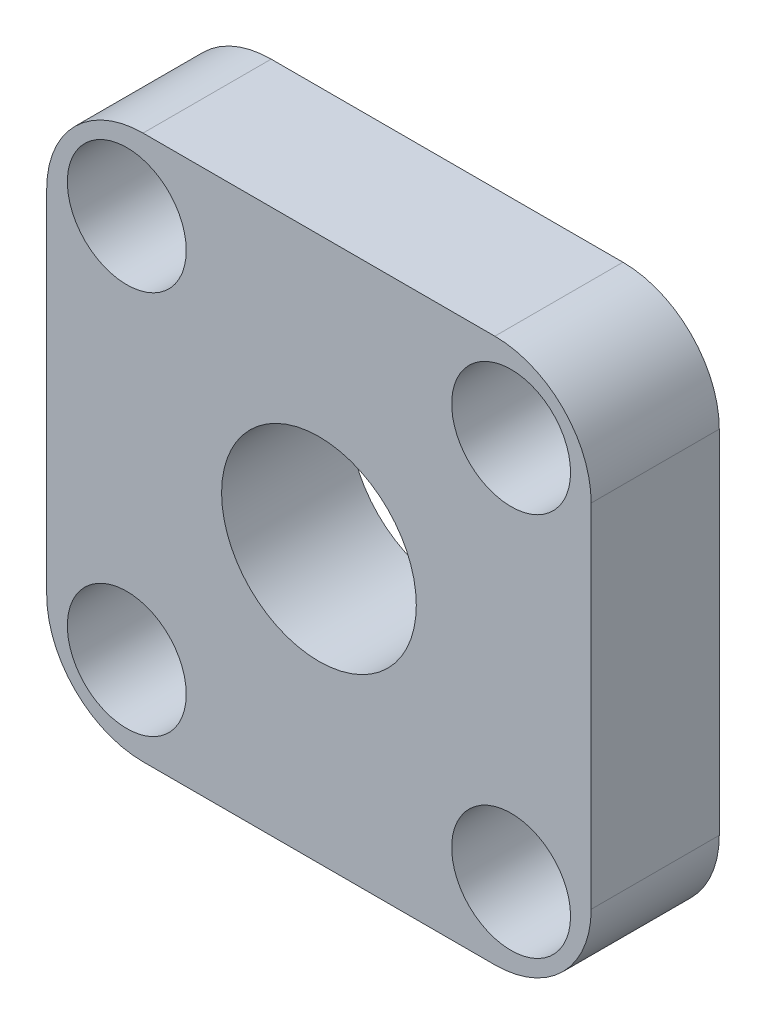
ISO-10303-21;
HEADER;
FILE_DESCRIPTION(('STEP AP214'),'2;1');
FILE_NAME('part.step','',(''),(''),'','','');
FILE_SCHEMA(('AUTOMOTIVE_DESIGN { 1 0 10303 214 1 1 1 1 }'));
ENDSEC;
DATA;
#1=APPLICATION_CONTEXT('core data for automotive mechanical design processes');
#2=APPLICATION_PROTOCOL_DEFINITION('international standard','automotive_design',2000,#1);
#3=PRODUCT_CONTEXT('',#1,'mechanical');
#4=PRODUCT('Part','Part','',(#3));
#5=PRODUCT_RELATED_PRODUCT_CATEGORY('part','',(#4));
#6=PRODUCT_DEFINITION_FORMATION('','',#4);
#7=PRODUCT_DEFINITION_CONTEXT('part definition',#1,'design');
#8=PRODUCT_DEFINITION('design','',#6,#7);
#9=PRODUCT_DEFINITION_SHAPE('','',#8);
#10=(LENGTH_UNIT() NAMED_UNIT(*) SI_UNIT(.MILLI.,.METRE.));
#11=(NAMED_UNIT(*) PLANE_ANGLE_UNIT() SI_UNIT($,.RADIAN.));
#12=(NAMED_UNIT(*) SI_UNIT($,.STERADIAN.) SOLID_ANGLE_UNIT());
#13=UNCERTAINTY_MEASURE_WITH_UNIT(LENGTH_MEASURE(1.E-05),#10,'distance_accuracy_value','');
#14=(GEOMETRIC_REPRESENTATION_CONTEXT(3) GLOBAL_UNCERTAINTY_ASSIGNED_CONTEXT((#13)) GLOBAL_UNIT_ASSIGNED_CONTEXT((#10,
#11,#12)) REPRESENTATION_CONTEXT('',''));
#15=CARTESIAN_POINT('',(0.,0.,0.));
#16=DIRECTION('',(0.,0.,1.));
#17=DIRECTION('',(1.,0.,0.));
#18=AXIS2_PLACEMENT_3D('',#15,#16,#17);
#19=CARTESIAN_POINT('',(-6.746875,-6.746875,3.17500000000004));
#20=DIRECTION('',(0.,0.,1.));
#21=DIRECTION('',(1.,0.,0.));
#22=AXIS2_PLACEMENT_3D('',#19,#20,#21);
#23=PLANE('',#22);
#24=CARTESIAN_POINT('',(4.7625,4.7625,3.17500000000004));
#25=DIRECTION('',(0.,0.,1.));
#26=DIRECTION('',(1.,0.,0.));
#27=AXIS2_PLACEMENT_3D('',#24,#25,#26);
#28=CIRCLE('',#27,1.4732);
#29=CARTESIAN_POINT('',(6.2357,4.7625,3.17500000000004));
#30=VERTEX_POINT('',#29);
#31=EDGE_CURVE('E210',#30,#30,#28,.T.);
#32=ORIENTED_EDGE('',*,*,#31,.F.);
#33=EDGE_LOOP('',(#32));
#34=FACE_BOUND('',#33,.T.);
#35=CARTESIAN_POINT('',(-4.7625,4.7625,3.17500000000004));
#36=DIRECTION('',(0.,0.,1.));
#37=DIRECTION('',(1.,0.,0.));
#38=AXIS2_PLACEMENT_3D('',#35,#36,#37);
#39=CIRCLE('',#38,1.4732);
#40=CARTESIAN_POINT('',(-3.2893,4.7625,3.17500000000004));
#41=VERTEX_POINT('',#40);
#42=EDGE_CURVE('E204',#41,#41,#39,.T.);
#43=ORIENTED_EDGE('',*,*,#42,.F.);
#44=EDGE_LOOP('',(#43));
#45=FACE_BOUND('',#44,.T.);
#46=CARTESIAN_POINT('',(-4.7625,-4.7625,3.17500000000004));
#47=DIRECTION('',(0.,0.,1.));
#48=DIRECTION('',(1.,0.,0.));
#49=AXIS2_PLACEMENT_3D('',#46,#47,#48);
#50=CIRCLE('',#49,1.4732);
#51=CARTESIAN_POINT('',(-3.2893,-4.7625,3.17500000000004));
#52=VERTEX_POINT('',#51);
#53=EDGE_CURVE('E198',#52,#52,#50,.T.);
#54=ORIENTED_EDGE('',*,*,#53,.F.);
#55=EDGE_LOOP('',(#54));
#56=FACE_BOUND('',#55,.T.);
#57=CARTESIAN_POINT('',(4.7625,-4.7625,3.17500000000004));
#58=DIRECTION('',(0.,0.,1.));
#59=DIRECTION('',(1.,0.,0.));
#60=AXIS2_PLACEMENT_3D('',#57,#58,#59);
#61=CIRCLE('',#60,1.4732);
#62=CARTESIAN_POINT('',(6.2357,-4.7625,3.17500000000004));
#63=VERTEX_POINT('',#62);
#64=EDGE_CURVE('E192',#63,#63,#61,.T.);
#65=ORIENTED_EDGE('',*,*,#64,.F.);
#66=EDGE_LOOP('',(#65));
#67=FACE_BOUND('',#66,.T.);
#68=DIRECTION('',(-1.,0.,0.));
#69=VECTOR('',#68,1.);
#70=CARTESIAN_POINT('',(-6.746875,6.746875,3.17500000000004));
#71=LINE('',#70,#69);
#72=CARTESIAN_POINT('',(4.359275,6.746875,3.17500000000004));
#73=VERTEX_POINT('',#72);
#74=CARTESIAN_POINT('',(-4.359275,6.746875,3.17500000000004));
#75=VERTEX_POINT('',#74);
#76=EDGE_CURVE('E143',#73,#75,#71,.T.);
#77=ORIENTED_EDGE('',*,*,#76,.T.);
#78=CARTESIAN_POINT('',(-4.359275,4.359275,3.17500000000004));
#79=DIRECTION('',(0.,0.,1.));
#80=DIRECTION('',(1.,0.,0.));
#81=AXIS2_PLACEMENT_3D('',#78,#79,#80);
#82=CIRCLE('',#81,2.3876);
#83=CARTESIAN_POINT('',(-6.746875,4.359275,3.17500000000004));
#84=VERTEX_POINT('',#83);
#85=EDGE_CURVE('E162',#75,#84,#82,.T.);
#86=ORIENTED_EDGE('',*,*,#85,.T.);
#87=DIRECTION('',(0.,-1.,0.));
#88=VECTOR('',#87,1.);
#89=CARTESIAN_POINT('',(-6.746875,6.746875,3.17500000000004));
#90=LINE('',#89,#88);
#91=CARTESIAN_POINT('',(-6.746875,-4.359275,3.17500000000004));
#92=VERTEX_POINT('',#91);
#93=EDGE_CURVE('E126',#84,#92,#90,.T.);
#94=ORIENTED_EDGE('',*,*,#93,.T.);
#95=CARTESIAN_POINT('',(-4.359275,-4.359275,3.17500000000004));
#96=DIRECTION('',(0.,0.,1.));
#97=DIRECTION('',(1.,0.,0.));
#98=AXIS2_PLACEMENT_3D('',#95,#96,#97);
#99=CIRCLE('',#98,2.3876);
#100=CARTESIAN_POINT('',(-4.359275,-6.746875,3.17500000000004));
#101=VERTEX_POINT('',#100);
#102=EDGE_CURVE('E157',#92,#101,#99,.T.);
#103=ORIENTED_EDGE('',*,*,#102,.T.);
#104=DIRECTION('',(1.,0.,0.));
#105=VECTOR('',#104,1.);
#106=CARTESIAN_POINT('',(-6.746875,-6.746875,3.17500000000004));
#107=LINE('',#106,#105);
#108=CARTESIAN_POINT('',(4.359275,-6.746875,3.17500000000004));
#109=VERTEX_POINT('',#108);
#110=EDGE_CURVE('E173',#101,#109,#107,.T.);
#111=ORIENTED_EDGE('',*,*,#110,.T.);
#112=CARTESIAN_POINT('',(4.359275,-4.359275,3.17500000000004));
#113=DIRECTION('',(0.,0.,1.));
#114=DIRECTION('',(1.,0.,0.));
#115=AXIS2_PLACEMENT_3D('',#112,#113,#114);
#116=CIRCLE('',#115,2.3876);
#117=CARTESIAN_POINT('',(6.746875,-4.359275,3.17500000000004));
#118=VERTEX_POINT('',#117);
#119=EDGE_CURVE('E62',#109,#118,#116,.T.);
#120=ORIENTED_EDGE('',*,*,#119,.T.);
#121=DIRECTION('',(0.,1.,0.));
#122=VECTOR('',#121,1.);
#123=CARTESIAN_POINT('',(6.746875,6.746875,3.17500000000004));
#124=LINE('',#123,#122);
#125=CARTESIAN_POINT('',(6.746875,4.359275,3.17500000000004));
#126=VERTEX_POINT('',#125);
#127=EDGE_CURVE('E181',#118,#126,#124,.T.);
#128=ORIENTED_EDGE('',*,*,#127,.T.);
#129=CARTESIAN_POINT('',(4.359275,4.359275,3.17500000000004));
#130=DIRECTION('',(0.,0.,1.));
#131=DIRECTION('',(1.,0.,0.));
#132=AXIS2_PLACEMENT_3D('',#129,#130,#131);
#133=CIRCLE('',#132,2.3876);
#134=EDGE_CURVE('E160',#126,#73,#133,.T.);
#135=ORIENTED_EDGE('',*,*,#134,.T.);
#136=EDGE_LOOP('',(#77,#86,#94,#103,#111,#120,#128,#135));
#137=FACE_BOUND('',#136,.T.);
#138=CARTESIAN_POINT('',(0.,0.,3.17500000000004));
#139=DIRECTION('',(0.,0.,1.));
#140=DIRECTION('',(1.,0.,0.));
#141=AXIS2_PLACEMENT_3D('',#138,#139,#140);
#142=CIRCLE('',#141,2.413);
#143=CARTESIAN_POINT('',(2.413,0.,3.17500000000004));
#144=VERTEX_POINT('',#143);
#145=EDGE_CURVE('E134',#144,#144,#142,.T.);
#146=ORIENTED_EDGE('',*,*,#145,.F.);
#147=EDGE_LOOP('',(#146));
#148=FACE_BOUND('',#147,.T.);
#149=ADVANCED_FACE('F40',(#34,#45,#56,#67,#137,#148),#23,.T.);
#150=CARTESIAN_POINT('',(-6.746875,-6.746875,0.));
#151=DIRECTION('',(0.,0.,1.));
#152=DIRECTION('',(1.,0.,0.));
#153=AXIS2_PLACEMENT_3D('',#150,#151,#152);
#154=PLANE('',#153);
#155=CARTESIAN_POINT('',(4.7625,4.7625,0.));
#156=DIRECTION('',(0.,0.,1.));
#157=DIRECTION('',(1.,0.,0.));
#158=AXIS2_PLACEMENT_3D('',#155,#156,#157);
#159=CIRCLE('',#158,1.4732);
#160=CARTESIAN_POINT('',(6.2357,4.7625,0.));
#161=VERTEX_POINT('',#160);
#162=EDGE_CURVE('E207',#161,#161,#159,.T.);
#163=ORIENTED_EDGE('',*,*,#162,.T.);
#164=EDGE_LOOP('',(#163));
#165=FACE_BOUND('',#164,.T.);
#166=CARTESIAN_POINT('',(-4.7625,4.7625,0.));
#167=DIRECTION('',(0.,0.,1.));
#168=DIRECTION('',(1.,0.,0.));
#169=AXIS2_PLACEMENT_3D('',#166,#167,#168);
#170=CIRCLE('',#169,1.4732);
#171=CARTESIAN_POINT('',(-3.2893,4.7625,0.));
#172=VERTEX_POINT('',#171);
#173=EDGE_CURVE('E201',#172,#172,#170,.T.);
#174=ORIENTED_EDGE('',*,*,#173,.T.);
#175=EDGE_LOOP('',(#174));
#176=FACE_BOUND('',#175,.T.);
#177=CARTESIAN_POINT('',(-4.7625,-4.7625,0.));
#178=DIRECTION('',(0.,0.,1.));
#179=DIRECTION('',(1.,0.,0.));
#180=AXIS2_PLACEMENT_3D('',#177,#178,#179);
#181=CIRCLE('',#180,1.4732);
#182=CARTESIAN_POINT('',(-3.2893,-4.7625,0.));
#183=VERTEX_POINT('',#182);
#184=EDGE_CURVE('E195',#183,#183,#181,.T.);
#185=ORIENTED_EDGE('',*,*,#184,.T.);
#186=EDGE_LOOP('',(#185));
#187=FACE_BOUND('',#186,.T.);
#188=CARTESIAN_POINT('',(4.7625,-4.7625,0.));
#189=DIRECTION('',(0.,0.,1.));
#190=DIRECTION('',(1.,0.,0.));
#191=AXIS2_PLACEMENT_3D('',#188,#189,#190);
#192=CIRCLE('',#191,1.4732);
#193=CARTESIAN_POINT('',(6.2357,-4.7625,0.));
#194=VERTEX_POINT('',#193);
#195=EDGE_CURVE('E188',#194,#194,#192,.T.);
#196=ORIENTED_EDGE('',*,*,#195,.T.);
#197=EDGE_LOOP('',(#196));
#198=FACE_BOUND('',#197,.T.);
#199=DIRECTION('',(0.,-1.,0.));
#200=VECTOR('',#199,1.);
#201=CARTESIAN_POINT('',(-6.746875,6.746875,0.));
#202=LINE('',#201,#200);
#203=CARTESIAN_POINT('',(-6.746875,4.359275,0.));
#204=VERTEX_POINT('',#203);
#205=CARTESIAN_POINT('',(-6.746875,-4.359275,0.));
#206=VERTEX_POINT('',#205);
#207=EDGE_CURVE('E123',#204,#206,#202,.T.);
#208=ORIENTED_EDGE('',*,*,#207,.F.);
#209=CARTESIAN_POINT('',(-4.359275,4.359275,0.));
#210=DIRECTION('',(0.,0.,1.));
#211=DIRECTION('',(1.,0.,0.));
#212=AXIS2_PLACEMENT_3D('',#209,#210,#211);
#213=CIRCLE('',#212,2.3876);
#214=CARTESIAN_POINT('',(-4.359275,6.746875,0.));
#215=VERTEX_POINT('',#214);
#216=EDGE_CURVE('E106',#204,#215,#213,.F.);
#217=ORIENTED_EDGE('',*,*,#216,.T.);
#218=DIRECTION('',(-1.,0.,0.));
#219=VECTOR('',#218,1.);
#220=CARTESIAN_POINT('',(-6.746875,6.746875,0.));
#221=LINE('',#220,#219);
#222=CARTESIAN_POINT('',(4.359275,6.746875,0.));
#223=VERTEX_POINT('',#222);
#224=EDGE_CURVE('E147',#223,#215,#221,.T.);
#225=ORIENTED_EDGE('',*,*,#224,.F.);
#226=CARTESIAN_POINT('',(4.359275,4.359275,0.));
#227=DIRECTION('',(0.,0.,1.));
#228=DIRECTION('',(1.,0.,0.));
#229=AXIS2_PLACEMENT_3D('',#226,#227,#228);
#230=CIRCLE('',#229,2.3876);
#231=CARTESIAN_POINT('',(6.746875,4.359275,0.));
#232=VERTEX_POINT('',#231);
#233=EDGE_CURVE('E117',#223,#232,#230,.F.);
#234=ORIENTED_EDGE('',*,*,#233,.T.);
#235=DIRECTION('',(0.,1.,0.));
#236=VECTOR('',#235,1.);
#237=CARTESIAN_POINT('',(6.746875,6.746875,0.));
#238=LINE('',#237,#236);
#239=CARTESIAN_POINT('',(6.746875,-4.359275,0.));
#240=VERTEX_POINT('',#239);
#241=EDGE_CURVE('E137',#240,#232,#238,.T.);
#242=ORIENTED_EDGE('',*,*,#241,.F.);
#243=CARTESIAN_POINT('',(4.359275,-4.359275,0.));
#244=DIRECTION('',(0.,0.,1.));
#245=DIRECTION('',(1.,0.,0.));
#246=AXIS2_PLACEMENT_3D('',#243,#244,#245);
#247=CIRCLE('',#246,2.3876);
#248=CARTESIAN_POINT('',(4.359275,-6.746875,0.));
#249=VERTEX_POINT('',#248);
#250=EDGE_CURVE('E151',#240,#249,#247,.F.);
#251=ORIENTED_EDGE('',*,*,#250,.T.);
#252=DIRECTION('',(1.,0.,0.));
#253=VECTOR('',#252,1.);
#254=CARTESIAN_POINT('',(-6.746875,-6.746875,0.));
#255=LINE('',#254,#253);
#256=CARTESIAN_POINT('',(-4.359275,-6.746875,0.));
#257=VERTEX_POINT('',#256);
#258=EDGE_CURVE('E133',#257,#249,#255,.T.);
#259=ORIENTED_EDGE('',*,*,#258,.F.);
#260=CARTESIAN_POINT('',(-4.359275,-4.359275,0.));
#261=DIRECTION('',(0.,0.,1.));
#262=DIRECTION('',(1.,0.,0.));
#263=AXIS2_PLACEMENT_3D('',#260,#261,#262);
#264=CIRCLE('',#263,2.3876);
#265=EDGE_CURVE('E127',#257,#206,#264,.F.);
#266=ORIENTED_EDGE('',*,*,#265,.T.);
#267=EDGE_LOOP('',(#208,#217,#225,#234,#242,#251,#259,#266));
#268=FACE_BOUND('',#267,.T.);
#269=CARTESIAN_POINT('',(0.,0.,0.));
#270=DIRECTION('',(0.,0.,1.));
#271=DIRECTION('',(1.,0.,0.));
#272=AXIS2_PLACEMENT_3D('',#269,#270,#271);
#273=CIRCLE('',#272,2.413);
#274=CARTESIAN_POINT('',(2.413,0.,0.));
#275=VERTEX_POINT('',#274);
#276=EDGE_CURVE('E140',#275,#275,#273,.T.);
#277=ORIENTED_EDGE('',*,*,#276,.T.);
#278=EDGE_LOOP('',(#277));
#279=FACE_BOUND('',#278,.T.);
#280=ADVANCED_FACE('F130',(#165,#176,#187,#198,#268,#279),#154,.F.);
#281=CARTESIAN_POINT('',(-6.746875,6.746875,3.17500000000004));
#282=DIRECTION('',(1.,0.,0.));
#283=DIRECTION('',(0.,1.,0.));
#284=AXIS2_PLACEMENT_3D('',#281,#282,#283);
#285=PLANE('',#284);
#286=ORIENTED_EDGE('',*,*,#93,.F.);
#287=DIRECTION('',(0.,0.,-1.));
#288=VECTOR('',#287,1.);
#289=CARTESIAN_POINT('',(-6.746875,4.359275,3.17500000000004));
#290=LINE('',#289,#288);
#291=EDGE_CURVE('E110',#84,#204,#290,.T.);
#292=ORIENTED_EDGE('',*,*,#291,.T.);
#293=ORIENTED_EDGE('',*,*,#207,.T.);
#294=DIRECTION('',(0.,0.,-1.));
#295=VECTOR('',#294,1.);
#296=CARTESIAN_POINT('',(-6.746875,-4.359275,3.17500000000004));
#297=LINE('',#296,#295);
#298=EDGE_CURVE('E128',#206,#92,#297,.F.);
#299=ORIENTED_EDGE('',*,*,#298,.T.);
#300=EDGE_LOOP('',(#286,#292,#293,#299));
#301=FACE_BOUND('',#300,.T.);
#302=ADVANCED_FACE('F122',(#301),#285,.F.);
#303=CARTESIAN_POINT('',(-6.746875,-6.746875,3.17500000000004));
#304=DIRECTION('',(0.,1.,0.));
#305=DIRECTION('',(0.,0.,1.));
#306=AXIS2_PLACEMENT_3D('',#303,#304,#305);
#307=PLANE('',#306);
#308=ORIENTED_EDGE('',*,*,#258,.T.);
#309=DIRECTION('',(0.,0.,-1.));
#310=VECTOR('',#309,1.);
#311=CARTESIAN_POINT('',(4.359275,-6.746875,3.17500000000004));
#312=LINE('',#311,#310);
#313=EDGE_CURVE('E11',#249,#109,#312,.F.);
#314=ORIENTED_EDGE('',*,*,#313,.T.);
#315=ORIENTED_EDGE('',*,*,#110,.F.);
#316=DIRECTION('',(0.,0.,-1.));
#317=VECTOR('',#316,1.);
#318=CARTESIAN_POINT('',(-4.359275,-6.746875,3.17500000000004));
#319=LINE('',#318,#317);
#320=EDGE_CURVE('E48',#101,#257,#319,.T.);
#321=ORIENTED_EDGE('',*,*,#320,.T.);
#322=EDGE_LOOP('',(#308,#314,#315,#321));
#323=FACE_BOUND('',#322,.T.);
#324=ADVANCED_FACE('F171',(#323),#307,.F.);
#325=CARTESIAN_POINT('',(6.746875,6.746875,3.17500000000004));
#326=DIRECTION('',(-1.,0.,0.));
#327=DIRECTION('',(0.,0.,1.));
#328=AXIS2_PLACEMENT_3D('',#325,#326,#327);
#329=PLANE('',#328);
#330=ORIENTED_EDGE('',*,*,#241,.T.);
#331=DIRECTION('',(0.,0.,-1.));
#332=VECTOR('',#331,1.);
#333=CARTESIAN_POINT('',(6.746875,4.359275,3.17500000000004));
#334=LINE('',#333,#332);
#335=EDGE_CURVE('E55',#232,#126,#334,.F.);
#336=ORIENTED_EDGE('',*,*,#335,.T.);
#337=ORIENTED_EDGE('',*,*,#127,.F.);
#338=DIRECTION('',(0.,0.,-1.));
#339=VECTOR('',#338,1.);
#340=CARTESIAN_POINT('',(6.746875,-4.359275,3.17500000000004));
#341=LINE('',#340,#339);
#342=EDGE_CURVE('E164',#118,#240,#341,.T.);
#343=ORIENTED_EDGE('',*,*,#342,.T.);
#344=EDGE_LOOP('',(#330,#336,#337,#343));
#345=FACE_BOUND('',#344,.T.);
#346=ADVANCED_FACE('F180',(#345),#329,.F.);
#347=CARTESIAN_POINT('',(-6.746875,6.746875,3.17500000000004));
#348=DIRECTION('',(0.,-1.,0.));
#349=DIRECTION('',(0.,0.,-1.));
#350=AXIS2_PLACEMENT_3D('',#347,#348,#349);
#351=PLANE('',#350);
#352=ORIENTED_EDGE('',*,*,#224,.T.);
#353=DIRECTION('',(0.,0.,-1.));
#354=VECTOR('',#353,1.);
#355=CARTESIAN_POINT('',(-4.359275,6.746875,3.17500000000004));
#356=LINE('',#355,#354);
#357=EDGE_CURVE('E111',#215,#75,#356,.F.);
#358=ORIENTED_EDGE('',*,*,#357,.T.);
#359=ORIENTED_EDGE('',*,*,#76,.F.);
#360=DIRECTION('',(0.,0.,-1.));
#361=VECTOR('',#360,1.);
#362=CARTESIAN_POINT('',(4.359275,6.746875,3.17500000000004));
#363=LINE('',#362,#361);
#364=EDGE_CURVE('E116',#73,#223,#363,.T.);
#365=ORIENTED_EDGE('',*,*,#364,.T.);
#366=EDGE_LOOP('',(#352,#358,#359,#365));
#367=FACE_BOUND('',#366,.T.);
#368=ADVANCED_FACE('F232',(#367),#351,.F.);
#369=CARTESIAN_POINT('',(0.,0.,3.17500000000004));
#370=DIRECTION('',(0.,0.,-1.));
#371=DIRECTION('',(-1.,0.,0.));
#372=AXIS2_PLACEMENT_3D('',#369,#370,#371);
#373=CYLINDRICAL_SURFACE('',#372,2.413);
#374=ORIENTED_EDGE('',*,*,#145,.T.);
#375=EDGE_LOOP('',(#374));
#376=FACE_BOUND('',#375,.T.);
#377=ORIENTED_EDGE('',*,*,#276,.F.);
#378=EDGE_LOOP('',(#377));
#379=FACE_BOUND('',#378,.T.);
#380=ADVANCED_FACE('F228',(#376,#379),#373,.F.);
#381=CARTESIAN_POINT('',(4.7625,-4.7625,3.17500000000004));
#382=DIRECTION('',(0.,0.,1.));
#383=DIRECTION('',(1.,0.,0.));
#384=AXIS2_PLACEMENT_3D('',#381,#382,#383);
#385=CYLINDRICAL_SURFACE('',#384,1.4732);
#386=ORIENTED_EDGE('',*,*,#195,.F.);
#387=EDGE_LOOP('',(#386));
#388=FACE_BOUND('',#387,.T.);
#389=ORIENTED_EDGE('',*,*,#64,.T.);
#390=EDGE_LOOP('',(#389));
#391=FACE_BOUND('',#390,.T.);
#392=ADVANCED_FACE('F231',(#388,#391),#385,.F.);
#393=CARTESIAN_POINT('',(-4.7625,-4.7625,3.17500000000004));
#394=DIRECTION('',(0.,0.,1.));
#395=DIRECTION('',(1.,0.,0.));
#396=AXIS2_PLACEMENT_3D('',#393,#394,#395);
#397=CYLINDRICAL_SURFACE('',#396,1.4732);
#398=ORIENTED_EDGE('',*,*,#184,.F.);
#399=EDGE_LOOP('',(#398));
#400=FACE_BOUND('',#399,.T.);
#401=ORIENTED_EDGE('',*,*,#53,.T.);
#402=EDGE_LOOP('',(#401));
#403=FACE_BOUND('',#402,.T.);
#404=ADVANCED_FACE('F297',(#400,#403),#397,.F.);
#405=CARTESIAN_POINT('',(-4.7625,4.7625,3.17500000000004));
#406=DIRECTION('',(0.,0.,1.));
#407=DIRECTION('',(1.,0.,0.));
#408=AXIS2_PLACEMENT_3D('',#405,#406,#407);
#409=CYLINDRICAL_SURFACE('',#408,1.4732);
#410=ORIENTED_EDGE('',*,*,#173,.F.);
#411=EDGE_LOOP('',(#410));
#412=FACE_BOUND('',#411,.T.);
#413=ORIENTED_EDGE('',*,*,#42,.T.);
#414=EDGE_LOOP('',(#413));
#415=FACE_BOUND('',#414,.T.);
#416=ADVANCED_FACE('F287',(#412,#415),#409,.F.);
#417=CARTESIAN_POINT('',(4.7625,4.7625,3.17500000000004));
#418=DIRECTION('',(0.,0.,1.));
#419=DIRECTION('',(1.,0.,0.));
#420=AXIS2_PLACEMENT_3D('',#417,#418,#419);
#421=CYLINDRICAL_SURFACE('',#420,1.4732);
#422=ORIENTED_EDGE('',*,*,#162,.F.);
#423=EDGE_LOOP('',(#422));
#424=FACE_BOUND('',#423,.T.);
#425=ORIENTED_EDGE('',*,*,#31,.T.);
#426=EDGE_LOOP('',(#425));
#427=FACE_BOUND('',#426,.T.);
#428=ADVANCED_FACE('F214',(#424,#427),#421,.F.);
#429=CARTESIAN_POINT('',(-4.359275,4.359275,3.17500000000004));
#430=DIRECTION('',(0.,0.,-1.));
#431=DIRECTION('',(-1.,0.,0.));
#432=AXIS2_PLACEMENT_3D('',#429,#430,#431);
#433=CYLINDRICAL_SURFACE('',#432,2.3876);
#434=ORIENTED_EDGE('',*,*,#85,.F.);
#435=ORIENTED_EDGE('',*,*,#357,.F.);
#436=ORIENTED_EDGE('',*,*,#216,.F.);
#437=ORIENTED_EDGE('',*,*,#291,.F.);
#438=EDGE_LOOP('',(#434,#435,#436,#437));
#439=FACE_BOUND('',#438,.T.);
#440=ADVANCED_FACE('F109',(#439),#433,.T.);
#441=CARTESIAN_POINT('',(4.359275,4.359275,3.17500000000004));
#442=DIRECTION('',(0.,0.,-1.));
#443=DIRECTION('',(-1.,0.,0.));
#444=AXIS2_PLACEMENT_3D('',#441,#442,#443);
#445=CYLINDRICAL_SURFACE('',#444,2.3876);
#446=ORIENTED_EDGE('',*,*,#134,.F.);
#447=ORIENTED_EDGE('',*,*,#335,.F.);
#448=ORIENTED_EDGE('',*,*,#233,.F.);
#449=ORIENTED_EDGE('',*,*,#364,.F.);
#450=EDGE_LOOP('',(#446,#447,#448,#449));
#451=FACE_BOUND('',#450,.T.);
#452=ADVANCED_FACE('F253',(#451),#445,.T.);
#453=CARTESIAN_POINT('',(4.359275,-4.359275,3.17500000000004));
#454=DIRECTION('',(0.,0.,-1.));
#455=DIRECTION('',(-1.,0.,0.));
#456=AXIS2_PLACEMENT_3D('',#453,#454,#455);
#457=CYLINDRICAL_SURFACE('',#456,2.3876);
#458=ORIENTED_EDGE('',*,*,#119,.F.);
#459=ORIENTED_EDGE('',*,*,#313,.F.);
#460=ORIENTED_EDGE('',*,*,#250,.F.);
#461=ORIENTED_EDGE('',*,*,#342,.F.);
#462=EDGE_LOOP('',(#458,#459,#460,#461));
#463=FACE_BOUND('',#462,.T.);
#464=ADVANCED_FACE('F179',(#463),#457,.T.);
#465=CARTESIAN_POINT('',(-4.359275,-4.359275,3.17500000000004));
#466=DIRECTION('',(0.,0.,-1.));
#467=DIRECTION('',(-1.,0.,0.));
#468=AXIS2_PLACEMENT_3D('',#465,#466,#467);
#469=CYLINDRICAL_SURFACE('',#468,2.3876);
#470=ORIENTED_EDGE('',*,*,#102,.F.);
#471=ORIENTED_EDGE('',*,*,#298,.F.);
#472=ORIENTED_EDGE('',*,*,#265,.F.);
#473=ORIENTED_EDGE('',*,*,#320,.F.);
#474=EDGE_LOOP('',(#470,#471,#472,#473));
#475=FACE_BOUND('',#474,.T.);
#476=ADVANCED_FACE('F42',(#475),#469,.T.);
#477=CLOSED_SHELL('',(#149,#280,#302,#324,#346,#368,#380,#392,#404,#416,#428,#440,#452,#464,#476));
#478=MANIFOLD_SOLID_BREP('B2',#477);
#479=ADVANCED_BREP_SHAPE_REPRESENTATION('',(#18,#478),#14);
#480=SHAPE_DEFINITION_REPRESENTATION(#9,#479);
ENDSEC;
END-ISO-10303-21;
